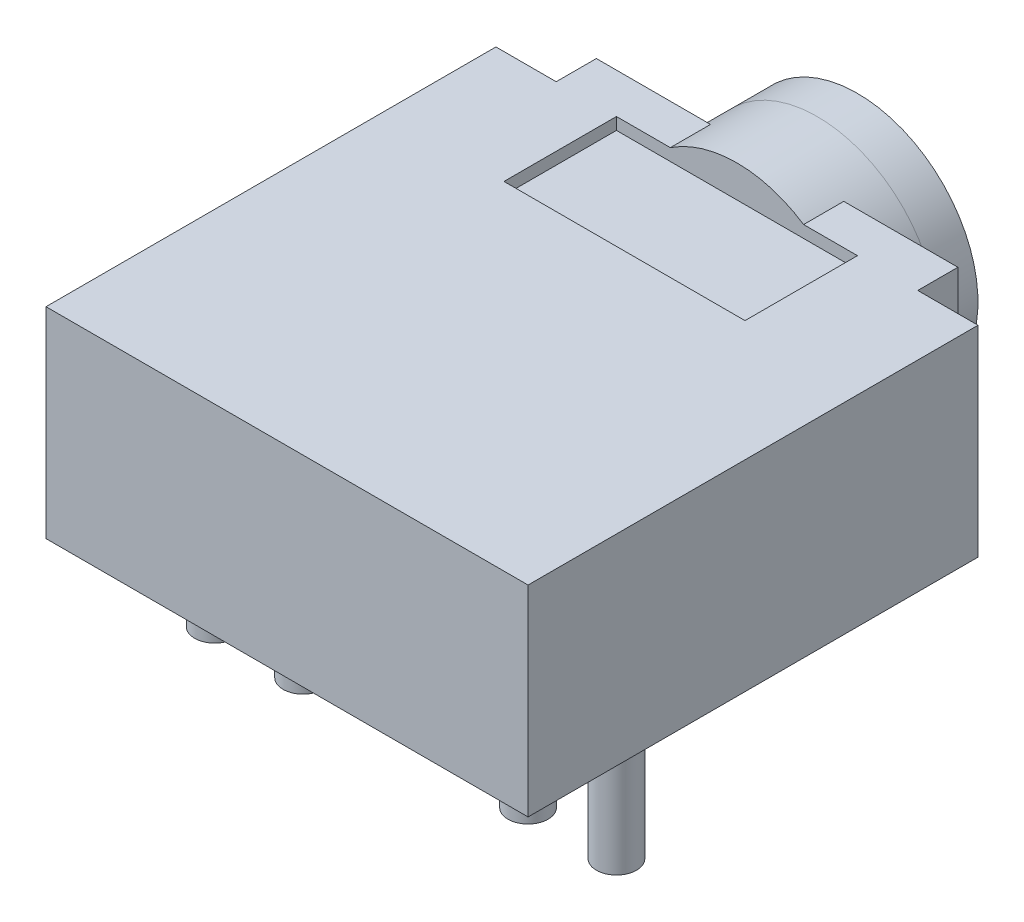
ISO-10303-21;
HEADER;
FILE_DESCRIPTION(('STEP AP214'),'2;1');
FILE_NAME('part.step','',(''),(''),'','','');
FILE_SCHEMA(('AUTOMOTIVE_DESIGN { 1 0 10303 214 1 1 1 1 }'));
ENDSEC;
DATA;
#1=APPLICATION_CONTEXT('core data for automotive mechanical design processes');
#2=APPLICATION_PROTOCOL_DEFINITION('international standard','automotive_design',2000,#1);
#3=PRODUCT_CONTEXT('',#1,'mechanical');
#4=PRODUCT('Part','Part','',(#3));
#5=PRODUCT_RELATED_PRODUCT_CATEGORY('part','',(#4));
#6=PRODUCT_DEFINITION_FORMATION('','',#4);
#7=PRODUCT_DEFINITION_CONTEXT('part definition',#1,'design');
#8=PRODUCT_DEFINITION('design','',#6,#7);
#9=PRODUCT_DEFINITION_SHAPE('','',#8);
#10=(LENGTH_UNIT() NAMED_UNIT(*) SI_UNIT(.MILLI.,.METRE.));
#11=(NAMED_UNIT(*) PLANE_ANGLE_UNIT() SI_UNIT($,.RADIAN.));
#12=(NAMED_UNIT(*) SI_UNIT($,.STERADIAN.) SOLID_ANGLE_UNIT());
#13=UNCERTAINTY_MEASURE_WITH_UNIT(LENGTH_MEASURE(1.E-05),#10,'distance_accuracy_value','');
#14=(GEOMETRIC_REPRESENTATION_CONTEXT(3) GLOBAL_UNCERTAINTY_ASSIGNED_CONTEXT((#13)) GLOBAL_UNIT_ASSIGNED_CONTEXT((#10,
#11,#12)) REPRESENTATION_CONTEXT('',''));
#15=CARTESIAN_POINT('',(0.,0.,0.));
#16=DIRECTION('',(0.,0.,1.));
#17=DIRECTION('',(1.,0.,0.));
#18=AXIS2_PLACEMENT_3D('',#15,#16,#17);
#19=CARTESIAN_POINT('',(-4.5,0.,-11.2));
#20=DIRECTION('',(0.,-1.,0.));
#21=DIRECTION('',(0.,0.,-1.));
#22=AXIS2_PLACEMENT_3D('',#19,#20,#21);
#23=PLANE('',#22);
#24=CARTESIAN_POINT('',(5.,0.,-3.2));
#25=DIRECTION('',(0.,-1.,0.));
#26=DIRECTION('',(0.,0.,1.));
#27=AXIS2_PLACEMENT_3D('',#24,#25,#26);
#28=CIRCLE('',#27,0.500000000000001);
#29=CARTESIAN_POINT('',(5.,0.,-2.7));
#30=VERTEX_POINT('',#29);
#31=EDGE_CURVE('E637',#30,#30,#28,.T.);
#32=ORIENTED_EDGE('',*,*,#31,.F.);
#33=EDGE_LOOP('',(#32));
#34=FACE_BOUND('',#33,.T.);
#35=CARTESIAN_POINT('',(-2.8,0.,-3.2));
#36=DIRECTION('',(0.,-1.,0.));
#37=DIRECTION('',(0.,0.,-1.));
#38=AXIS2_PLACEMENT_3D('',#35,#36,#37);
#39=CIRCLE('',#38,0.5);
#40=CARTESIAN_POINT('',(-2.8,0.,-3.7));
#41=VERTEX_POINT('',#40);
#42=EDGE_CURVE('E654',#41,#41,#39,.T.);
#43=ORIENTED_EDGE('',*,*,#42,.F.);
#44=EDGE_LOOP('',(#43));
#45=FACE_BOUND('',#44,.T.);
#46=DIRECTION('',(1.,0.,0.));
#47=VECTOR('',#46,1.);
#48=CARTESIAN_POINT('',(-4.5,0.,-11.2));
#49=LINE('',#48,#47);
#50=CARTESIAN_POINT('',(-1.6583123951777,0.,-11.2));
#51=VERTEX_POINT('',#50);
#52=CARTESIAN_POINT('',(1.6583123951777,0.,-11.2));
#53=VERTEX_POINT('',#52);
#54=EDGE_CURVE('E258',#51,#53,#49,.T.);
#55=ORIENTED_EDGE('',*,*,#54,.T.);
#56=DIRECTION('',(0.,0.,1.));
#57=VECTOR('',#56,1.);
#58=CARTESIAN_POINT('',(1.6583123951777,0.,-13.2));
#59=LINE('',#58,#57);
#60=CARTESIAN_POINT('',(1.6583123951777,0.,-12.2));
#61=VERTEX_POINT('',#60);
#62=EDGE_CURVE('E157',#53,#61,#59,.F.);
#63=ORIENTED_EDGE('',*,*,#62,.T.);
#64=DIRECTION('',(-1.,0.,0.));
#65=VECTOR('',#64,1.);
#66=CARTESIAN_POINT('',(4.5,0.,-12.2));
#67=LINE('',#66,#65);
#68=CARTESIAN_POINT('',(4.5,0.,-12.2));
#69=VERTEX_POINT('',#68);
#70=EDGE_CURVE('E212',#69,#61,#67,.T.);
#71=ORIENTED_EDGE('',*,*,#70,.F.);
#72=DIRECTION('',(0.,0.,-1.));
#73=VECTOR('',#72,1.);
#74=CARTESIAN_POINT('',(4.5,0.,-12.2));
#75=LINE('',#74,#73);
#76=CARTESIAN_POINT('',(4.5,0.,-11.2));
#77=VERTEX_POINT('',#76);
#78=EDGE_CURVE('E209',#77,#69,#75,.T.);
#79=ORIENTED_EDGE('',*,*,#78,.F.);
#80=DIRECTION('',(-1.,0.,0.));
#81=VECTOR('',#80,1.);
#82=CARTESIAN_POINT('',(4.5,0.,-11.2));
#83=LINE('',#82,#81);
#84=CARTESIAN_POINT('',(6.,0.,-11.2));
#85=VERTEX_POINT('',#84);
#86=EDGE_CURVE('E207',#85,#77,#83,.T.);
#87=ORIENTED_EDGE('',*,*,#86,.F.);
#88=DIRECTION('',(0.,0.,-1.));
#89=VECTOR('',#88,1.);
#90=CARTESIAN_POINT('',(6.,0.,-11.2));
#91=LINE('',#90,#89);
#92=CARTESIAN_POINT('',(6.,0.,0.));
#93=VERTEX_POINT('',#92);
#94=EDGE_CURVE('E205',#93,#85,#91,.T.);
#95=ORIENTED_EDGE('',*,*,#94,.F.);
#96=DIRECTION('',(1.,0.,0.));
#97=VECTOR('',#96,1.);
#98=CARTESIAN_POINT('',(-6.,0.,0.));
#99=LINE('',#98,#97);
#100=CARTESIAN_POINT('',(-6.,0.,0.));
#101=VERTEX_POINT('',#100);
#102=EDGE_CURVE('E203',#101,#93,#99,.T.);
#103=ORIENTED_EDGE('',*,*,#102,.F.);
#104=DIRECTION('',(0.,0.,1.));
#105=VECTOR('',#104,1.);
#106=CARTESIAN_POINT('',(-6.,0.,-11.2));
#107=LINE('',#106,#105);
#108=CARTESIAN_POINT('',(-6.,0.,-11.2));
#109=VERTEX_POINT('',#108);
#110=EDGE_CURVE('E201',#109,#101,#107,.T.);
#111=ORIENTED_EDGE('',*,*,#110,.F.);
#112=DIRECTION('',(-1.,0.,0.));
#113=VECTOR('',#112,1.);
#114=CARTESIAN_POINT('',(-4.5,0.,-11.2));
#115=LINE('',#114,#113);
#116=CARTESIAN_POINT('',(-4.5,0.,-11.2));
#117=VERTEX_POINT('',#116);
#118=EDGE_CURVE('E199',#117,#109,#115,.T.);
#119=ORIENTED_EDGE('',*,*,#118,.F.);
#120=DIRECTION('',(0.,0.,1.));
#121=VECTOR('',#120,1.);
#122=CARTESIAN_POINT('',(-4.5,0.,-12.2));
#123=LINE('',#122,#121);
#124=CARTESIAN_POINT('',(-4.5,0.,-12.2));
#125=VERTEX_POINT('',#124);
#126=EDGE_CURVE('E191',#125,#117,#123,.T.);
#127=ORIENTED_EDGE('',*,*,#126,.F.);
#128=CARTESIAN_POINT('',(-1.6583123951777,0.,-12.2));
#129=VERTEX_POINT('',#128);
#130=EDGE_CURVE('E211',#129,#125,#67,.T.);
#131=ORIENTED_EDGE('',*,*,#130,.F.);
#132=DIRECTION('',(0.,0.,1.));
#133=VECTOR('',#132,1.);
#134=CARTESIAN_POINT('',(-1.6583123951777,0.,-13.2));
#135=LINE('',#134,#133);
#136=EDGE_CURVE('E260',#129,#51,#135,.T.);
#137=ORIENTED_EDGE('',*,*,#136,.T.);
#138=EDGE_LOOP('',(#55,#63,#71,#79,#87,#95,#103,#111,#119,#127,#131,#137));
#139=FACE_BOUND('',#138,.T.);
#140=CARTESIAN_POINT('',(-5.,0.,-3.2));
#141=DIRECTION('',(0.,-1.,0.));
#142=DIRECTION('',(0.,0.,-1.));
#143=AXIS2_PLACEMENT_3D('',#140,#141,#142);
#144=CIRCLE('',#143,0.500000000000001);
#145=CARTESIAN_POINT('',(-5.,0.,-3.7));
#146=VERTEX_POINT('',#145);
#147=EDGE_CURVE('E660',#146,#146,#144,.T.);
#148=ORIENTED_EDGE('',*,*,#147,.F.);
#149=EDGE_LOOP('',(#148));
#150=FACE_BOUND('',#149,.T.);
#151=CARTESIAN_POINT('',(0.,0.,-8.4));
#152=DIRECTION('',(0.,-1.,0.));
#153=DIRECTION('',(0.,0.,-1.));
#154=AXIS2_PLACEMENT_3D('',#151,#152,#153);
#155=CIRCLE('',#154,0.5);
#156=CARTESIAN_POINT('',(0.,0.,-8.9));
#157=VERTEX_POINT('',#156);
#158=EDGE_CURVE('E648',#157,#157,#155,.T.);
#159=ORIENTED_EDGE('',*,*,#158,.F.);
#160=EDGE_LOOP('',(#159));
#161=FACE_BOUND('',#160,.T.);
#162=CARTESIAN_POINT('',(2.8,0.,-3.2));
#163=DIRECTION('',(0.,-1.,0.));
#164=DIRECTION('',(0.,0.,1.));
#165=AXIS2_PLACEMENT_3D('',#162,#163,#164);
#166=CIRCLE('',#165,0.5);
#167=CARTESIAN_POINT('',(2.8,0.,-2.7));
#168=VERTEX_POINT('',#167);
#169=EDGE_CURVE('E638',#168,#168,#166,.T.);
#170=ORIENTED_EDGE('',*,*,#169,.F.);
#171=EDGE_LOOP('',(#170));
#172=FACE_BOUND('',#171,.T.);
#173=ADVANCED_FACE('F30',(#34,#45,#139,#150,#161,#172),#23,.T.);
#174=CARTESIAN_POINT('',(4.5,5.,-12.2));
#175=DIRECTION('',(0.,0.,1.));
#176=DIRECTION('',(1.,0.,0.));
#177=AXIS2_PLACEMENT_3D('',#174,#175,#176);
#178=PLANE('',#177);
#179=CARTESIAN_POINT('',(0.,2.5,-12.2));
#180=DIRECTION('',(0.,0.,1.));
#181=DIRECTION('',(1.,0.,0.));
#182=AXIS2_PLACEMENT_3D('',#179,#180,#181);
#183=CIRCLE('',#182,3.);
#184=CARTESIAN_POINT('',(-1.6583123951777,5.,-12.2));
#185=VERTEX_POINT('',#184);
#186=EDGE_CURVE('E153',#129,#185,#183,.F.);
#187=ORIENTED_EDGE('',*,*,#186,.F.);
#188=ORIENTED_EDGE('',*,*,#130,.T.);
#189=DIRECTION('',(0.,-1.,0.));
#190=VECTOR('',#189,1.);
#191=CARTESIAN_POINT('',(-4.5,5.,-12.2));
#192=LINE('',#191,#190);
#193=CARTESIAN_POINT('',(-4.5,5.,-12.2));
#194=VERTEX_POINT('',#193);
#195=EDGE_CURVE('E234',#194,#125,#192,.T.);
#196=ORIENTED_EDGE('',*,*,#195,.F.);
#197=DIRECTION('',(-1.,0.,0.));
#198=VECTOR('',#197,1.);
#199=CARTESIAN_POINT('',(4.5,5.,-12.2));
#200=LINE('',#199,#198);
#201=EDGE_CURVE('E230',#185,#194,#200,.T.);
#202=ORIENTED_EDGE('',*,*,#201,.F.);
#203=EDGE_LOOP('',(#187,#188,#196,#202));
#204=FACE_BOUND('',#203,.T.);
#205=ADVANCED_FACE('F300',(#204),#178,.F.);
#206=CARTESIAN_POINT('',(1.6583123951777,5.,-12.2));
#207=VERTEX_POINT('',#206);
#208=EDGE_CURVE('E268',#207,#61,#183,.F.);
#209=ORIENTED_EDGE('',*,*,#208,.F.);
#210=CARTESIAN_POINT('',(4.5,5.,-12.2));
#211=VERTEX_POINT('',#210);
#212=EDGE_CURVE('E231',#211,#207,#200,.T.);
#213=ORIENTED_EDGE('',*,*,#212,.F.);
#214=DIRECTION('',(0.,-1.,0.));
#215=VECTOR('',#214,1.);
#216=CARTESIAN_POINT('',(4.5,5.,-12.2));
#217=LINE('',#216,#215);
#218=EDGE_CURVE('E237',#211,#69,#217,.T.);
#219=ORIENTED_EDGE('',*,*,#218,.T.);
#220=ORIENTED_EDGE('',*,*,#70,.T.);
#221=EDGE_LOOP('',(#209,#213,#219,#220));
#222=FACE_BOUND('',#221,.T.);
#223=ADVANCED_FACE('F305',(#222),#178,.F.);
#224=CARTESIAN_POINT('',(-4.5,5.,-11.2));
#225=DIRECTION('',(0.,-1.,0.));
#226=DIRECTION('',(0.,0.,-1.));
#227=AXIS2_PLACEMENT_3D('',#224,#225,#226);
#228=PLANE('',#227);
#229=DIRECTION('',(0.,0.,1.));
#230=VECTOR('',#229,1.);
#231=CARTESIAN_POINT('',(1.6583123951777,5.,-13.2));
#232=LINE('',#231,#230);
#233=CARTESIAN_POINT('',(1.6583123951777,5.,-11.2));
#234=VERTEX_POINT('',#233);
#235=EDGE_CURVE('E271',#234,#207,#232,.F.);
#236=ORIENTED_EDGE('',*,*,#235,.F.);
#237=DIRECTION('',(-1.,0.,0.));
#238=VECTOR('',#237,1.);
#239=CARTESIAN_POINT('',(-3.,5.,-11.2));
#240=LINE('',#239,#238);
#241=CARTESIAN_POINT('',(3.,5.,-11.2));
#242=VERTEX_POINT('',#241);
#243=EDGE_CURVE('E165',#242,#234,#240,.T.);
#244=ORIENTED_EDGE('',*,*,#243,.F.);
#245=DIRECTION('',(0.,0.,-1.));
#246=VECTOR('',#245,1.);
#247=CARTESIAN_POINT('',(3.,5.,-11.2));
#248=LINE('',#247,#246);
#249=CARTESIAN_POINT('',(3.,5.,-8.4));
#250=VERTEX_POINT('',#249);
#251=EDGE_CURVE('E170',#250,#242,#248,.T.);
#252=ORIENTED_EDGE('',*,*,#251,.F.);
#253=DIRECTION('',(1.,0.,0.));
#254=VECTOR('',#253,1.);
#255=CARTESIAN_POINT('',(-3.,5.,-8.4));
#256=LINE('',#255,#254);
#257=CARTESIAN_POINT('',(-3.,5.,-8.4));
#258=VERTEX_POINT('',#257);
#259=EDGE_CURVE('E174',#258,#250,#256,.T.);
#260=ORIENTED_EDGE('',*,*,#259,.F.);
#261=DIRECTION('',(0.,0.,1.));
#262=VECTOR('',#261,1.);
#263=CARTESIAN_POINT('',(-3.,5.,-11.2));
#264=LINE('',#263,#262);
#265=CARTESIAN_POINT('',(-3.,5.,-11.2));
#266=VERTEX_POINT('',#265);
#267=EDGE_CURVE('E56',#266,#258,#264,.T.);
#268=ORIENTED_EDGE('',*,*,#267,.F.);
#269=CARTESIAN_POINT('',(-1.6583123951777,5.,-11.2));
#270=VERTEX_POINT('',#269);
#271=EDGE_CURVE('E163',#270,#266,#240,.T.);
#272=ORIENTED_EDGE('',*,*,#271,.F.);
#273=DIRECTION('',(0.,0.,1.));
#274=VECTOR('',#273,1.);
#275=CARTESIAN_POINT('',(-1.6583123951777,5.,-13.2));
#276=LINE('',#275,#274);
#277=EDGE_CURVE('E147',#185,#270,#276,.T.);
#278=ORIENTED_EDGE('',*,*,#277,.F.);
#279=ORIENTED_EDGE('',*,*,#201,.T.);
#280=DIRECTION('',(0.,0.,1.));
#281=VECTOR('',#280,1.);
#282=CARTESIAN_POINT('',(-4.5,5.,-12.2));
#283=LINE('',#282,#281);
#284=CARTESIAN_POINT('',(-4.5,5.,-11.2));
#285=VERTEX_POINT('',#284);
#286=EDGE_CURVE('E215',#194,#285,#283,.T.);
#287=ORIENTED_EDGE('',*,*,#286,.T.);
#288=DIRECTION('',(-1.,0.,0.));
#289=VECTOR('',#288,1.);
#290=CARTESIAN_POINT('',(-4.5,5.,-11.2));
#291=LINE('',#290,#289);
#292=CARTESIAN_POINT('',(-6.,5.,-11.2));
#293=VERTEX_POINT('',#292);
#294=EDGE_CURVE('E218',#285,#293,#291,.T.);
#295=ORIENTED_EDGE('',*,*,#294,.T.);
#296=DIRECTION('',(0.,0.,1.));
#297=VECTOR('',#296,1.);
#298=CARTESIAN_POINT('',(-6.,5.,-11.2));
#299=LINE('',#298,#297);
#300=CARTESIAN_POINT('',(-6.,5.,0.));
#301=VERTEX_POINT('',#300);
#302=EDGE_CURVE('E220',#293,#301,#299,.T.);
#303=ORIENTED_EDGE('',*,*,#302,.T.);
#304=DIRECTION('',(1.,0.,0.));
#305=VECTOR('',#304,1.);
#306=CARTESIAN_POINT('',(-6.,5.,0.));
#307=LINE('',#306,#305);
#308=CARTESIAN_POINT('',(6.,5.,0.));
#309=VERTEX_POINT('',#308);
#310=EDGE_CURVE('E222',#301,#309,#307,.T.);
#311=ORIENTED_EDGE('',*,*,#310,.T.);
#312=DIRECTION('',(0.,0.,-1.));
#313=VECTOR('',#312,1.);
#314=CARTESIAN_POINT('',(6.,5.,-11.2));
#315=LINE('',#314,#313);
#316=CARTESIAN_POINT('',(6.,5.,-11.2));
#317=VERTEX_POINT('',#316);
#318=EDGE_CURVE('E224',#309,#317,#315,.T.);
#319=ORIENTED_EDGE('',*,*,#318,.T.);
#320=DIRECTION('',(-1.,0.,0.));
#321=VECTOR('',#320,1.);
#322=CARTESIAN_POINT('',(4.5,5.,-11.2));
#323=LINE('',#322,#321);
#324=CARTESIAN_POINT('',(4.5,5.,-11.2));
#325=VERTEX_POINT('',#324);
#326=EDGE_CURVE('E226',#317,#325,#323,.T.);
#327=ORIENTED_EDGE('',*,*,#326,.T.);
#328=DIRECTION('',(0.,0.,-1.));
#329=VECTOR('',#328,1.);
#330=CARTESIAN_POINT('',(4.5,5.,-12.2));
#331=LINE('',#330,#329);
#332=EDGE_CURVE('E228',#325,#211,#331,.T.);
#333=ORIENTED_EDGE('',*,*,#332,.T.);
#334=ORIENTED_EDGE('',*,*,#212,.T.);
#335=EDGE_LOOP('',(#236,#244,#252,#260,#268,#272,#278,#279,#287,#295,#303,#311,#319,#327,#333,#334));
#336=FACE_BOUND('',#335,.T.);
#337=ADVANCED_FACE('F168',(#336),#228,.F.);
#338=CARTESIAN_POINT('',(-4.5,5.,-12.2));
#339=DIRECTION('',(1.,0.,0.));
#340=DIRECTION('',(0.,0.,-1.));
#341=AXIS2_PLACEMENT_3D('',#338,#339,#340);
#342=PLANE('',#341);
#343=ORIENTED_EDGE('',*,*,#126,.T.);
#344=DIRECTION('',(0.,-1.,0.));
#345=VECTOR('',#344,1.);
#346=CARTESIAN_POINT('',(-4.5,5.,-11.2));
#347=LINE('',#346,#345);
#348=EDGE_CURVE('E11',#285,#117,#347,.T.);
#349=ORIENTED_EDGE('',*,*,#348,.F.);
#350=ORIENTED_EDGE('',*,*,#286,.F.);
#351=ORIENTED_EDGE('',*,*,#195,.T.);
#352=EDGE_LOOP('',(#343,#349,#350,#351));
#353=FACE_BOUND('',#352,.T.);
#354=ADVANCED_FACE('F32',(#353),#342,.F.);
#355=CARTESIAN_POINT('',(-4.5,5.,-11.2));
#356=DIRECTION('',(0.,0.,1.));
#357=DIRECTION('',(1.,0.,0.));
#358=AXIS2_PLACEMENT_3D('',#355,#356,#357);
#359=PLANE('',#358);
#360=ORIENTED_EDGE('',*,*,#118,.T.);
#361=DIRECTION('',(0.,-1.,0.));
#362=VECTOR('',#361,1.);
#363=CARTESIAN_POINT('',(-6.,5.,-11.2));
#364=LINE('',#363,#362);
#365=EDGE_CURVE('E41',#293,#109,#364,.T.);
#366=ORIENTED_EDGE('',*,*,#365,.F.);
#367=ORIENTED_EDGE('',*,*,#294,.F.);
#368=ORIENTED_EDGE('',*,*,#348,.T.);
#369=EDGE_LOOP('',(#360,#366,#367,#368));
#370=FACE_BOUND('',#369,.T.);
#371=ADVANCED_FACE('F326',(#370),#359,.F.);
#372=CARTESIAN_POINT('',(-6.,5.,-11.2));
#373=DIRECTION('',(1.,0.,0.));
#374=DIRECTION('',(0.,0.,-1.));
#375=AXIS2_PLACEMENT_3D('',#372,#373,#374);
#376=PLANE('',#375);
#377=ORIENTED_EDGE('',*,*,#110,.T.);
#378=DIRECTION('',(0.,-1.,0.));
#379=VECTOR('',#378,1.);
#380=CARTESIAN_POINT('',(-6.,5.,0.));
#381=LINE('',#380,#379);
#382=EDGE_CURVE('E249',#301,#101,#381,.T.);
#383=ORIENTED_EDGE('',*,*,#382,.F.);
#384=ORIENTED_EDGE('',*,*,#302,.F.);
#385=ORIENTED_EDGE('',*,*,#365,.T.);
#386=EDGE_LOOP('',(#377,#383,#384,#385));
#387=FACE_BOUND('',#386,.T.);
#388=ADVANCED_FACE('F323',(#387),#376,.F.);
#389=CARTESIAN_POINT('',(-6.,5.,0.));
#390=DIRECTION('',(0.,0.,-1.));
#391=DIRECTION('',(-1.,0.,0.));
#392=AXIS2_PLACEMENT_3D('',#389,#390,#391);
#393=PLANE('',#392);
#394=ORIENTED_EDGE('',*,*,#102,.T.);
#395=DIRECTION('',(0.,-1.,0.));
#396=VECTOR('',#395,1.);
#397=CARTESIAN_POINT('',(6.,5.,0.));
#398=LINE('',#397,#396);
#399=EDGE_CURVE('E246',#309,#93,#398,.T.);
#400=ORIENTED_EDGE('',*,*,#399,.F.);
#401=ORIENTED_EDGE('',*,*,#310,.F.);
#402=ORIENTED_EDGE('',*,*,#382,.T.);
#403=EDGE_LOOP('',(#394,#400,#401,#402));
#404=FACE_BOUND('',#403,.T.);
#405=ADVANCED_FACE('F319',(#404),#393,.F.);
#406=CARTESIAN_POINT('',(6.,5.,-11.2));
#407=DIRECTION('',(-1.,0.,0.));
#408=DIRECTION('',(0.,0.,1.));
#409=AXIS2_PLACEMENT_3D('',#406,#407,#408);
#410=PLANE('',#409);
#411=ORIENTED_EDGE('',*,*,#94,.T.);
#412=DIRECTION('',(0.,-1.,0.));
#413=VECTOR('',#412,1.);
#414=CARTESIAN_POINT('',(6.,5.,-11.2));
#415=LINE('',#414,#413);
#416=EDGE_CURVE('E243',#317,#85,#415,.T.);
#417=ORIENTED_EDGE('',*,*,#416,.F.);
#418=ORIENTED_EDGE('',*,*,#318,.F.);
#419=ORIENTED_EDGE('',*,*,#399,.T.);
#420=EDGE_LOOP('',(#411,#417,#418,#419));
#421=FACE_BOUND('',#420,.T.);
#422=ADVANCED_FACE('F315',(#421),#410,.F.);
#423=CARTESIAN_POINT('',(4.5,5.,-11.2));
#424=DIRECTION('',(0.,0.,1.));
#425=DIRECTION('',(1.,0.,0.));
#426=AXIS2_PLACEMENT_3D('',#423,#424,#425);
#427=PLANE('',#426);
#428=ORIENTED_EDGE('',*,*,#86,.T.);
#429=DIRECTION('',(0.,-1.,0.));
#430=VECTOR('',#429,1.);
#431=CARTESIAN_POINT('',(4.5,5.,-11.2));
#432=LINE('',#431,#430);
#433=EDGE_CURVE('E240',#325,#77,#432,.T.);
#434=ORIENTED_EDGE('',*,*,#433,.F.);
#435=ORIENTED_EDGE('',*,*,#326,.F.);
#436=ORIENTED_EDGE('',*,*,#416,.T.);
#437=EDGE_LOOP('',(#428,#434,#435,#436));
#438=FACE_BOUND('',#437,.T.);
#439=ADVANCED_FACE('F294',(#438),#427,.F.);
#440=CARTESIAN_POINT('',(4.5,5.,-12.2));
#441=DIRECTION('',(-1.,0.,0.));
#442=DIRECTION('',(0.,0.,1.));
#443=AXIS2_PLACEMENT_3D('',#440,#441,#442);
#444=PLANE('',#443);
#445=ORIENTED_EDGE('',*,*,#78,.T.);
#446=ORIENTED_EDGE('',*,*,#218,.F.);
#447=ORIENTED_EDGE('',*,*,#332,.F.);
#448=ORIENTED_EDGE('',*,*,#433,.T.);
#449=EDGE_LOOP('',(#445,#446,#447,#448));
#450=FACE_BOUND('',#449,.T.);
#451=ADVANCED_FACE('F287',(#450),#444,.F.);
#452=CARTESIAN_POINT('',(-3.,4.7,-11.2));
#453=DIRECTION('',(-1.,0.,0.));
#454=DIRECTION('',(0.,0.,1.));
#455=AXIS2_PLACEMENT_3D('',#452,#453,#454);
#456=PLANE('',#455);
#457=ORIENTED_EDGE('',*,*,#267,.T.);
#458=DIRECTION('',(0.,1.,0.));
#459=VECTOR('',#458,1.);
#460=CARTESIAN_POINT('',(-3.,4.7,-8.4));
#461=LINE('',#460,#459);
#462=CARTESIAN_POINT('',(-3.,4.7,-8.4));
#463=VERTEX_POINT('',#462);
#464=EDGE_CURVE('E188',#463,#258,#461,.T.);
#465=ORIENTED_EDGE('',*,*,#464,.F.);
#466=DIRECTION('',(0.,0.,1.));
#467=VECTOR('',#466,1.);
#468=CARTESIAN_POINT('',(-3.,4.7,-11.2));
#469=LINE('',#468,#467);
#470=CARTESIAN_POINT('',(-3.,4.7,-11.2));
#471=VERTEX_POINT('',#470);
#472=EDGE_CURVE('E172',#471,#463,#469,.T.);
#473=ORIENTED_EDGE('',*,*,#472,.F.);
#474=DIRECTION('',(0.,1.,0.));
#475=VECTOR('',#474,1.);
#476=CARTESIAN_POINT('',(-3.,4.7,-11.2));
#477=LINE('',#476,#475);
#478=EDGE_CURVE('E189',#471,#266,#477,.T.);
#479=ORIENTED_EDGE('',*,*,#478,.T.);
#480=EDGE_LOOP('',(#457,#465,#473,#479));
#481=FACE_BOUND('',#480,.T.);
#482=ADVANCED_FACE('F285',(#481),#456,.F.);
#483=CARTESIAN_POINT('',(-3.,4.7,-11.2));
#484=DIRECTION('',(0.,0.,-1.));
#485=DIRECTION('',(-1.,0.,0.));
#486=AXIS2_PLACEMENT_3D('',#483,#484,#485);
#487=PLANE('',#486);
#488=ORIENTED_EDGE('',*,*,#478,.F.);
#489=DIRECTION('',(-1.,0.,0.));
#490=VECTOR('',#489,1.);
#491=CARTESIAN_POINT('',(-3.,4.7,-11.2));
#492=LINE('',#491,#490);
#493=CARTESIAN_POINT('',(3.,4.7,-11.2));
#494=VERTEX_POINT('',#493);
#495=EDGE_CURVE('E186',#494,#471,#492,.T.);
#496=ORIENTED_EDGE('',*,*,#495,.F.);
#497=DIRECTION('',(0.,1.,0.));
#498=VECTOR('',#497,1.);
#499=CARTESIAN_POINT('',(3.,4.7,-11.2));
#500=LINE('',#499,#498);
#501=EDGE_CURVE('E192',#494,#242,#500,.T.);
#502=ORIENTED_EDGE('',*,*,#501,.T.);
#503=ORIENTED_EDGE('',*,*,#243,.T.);
#504=CARTESIAN_POINT('',(0.,2.5,-11.2));
#505=DIRECTION('',(0.,0.,-1.));
#506=DIRECTION('',(-1.,0.,0.));
#507=AXIS2_PLACEMENT_3D('',#504,#505,#506);
#508=CIRCLE('',#507,3.);
#509=EDGE_CURVE('E150',#270,#234,#508,.T.);
#510=ORIENTED_EDGE('',*,*,#509,.F.);
#511=ORIENTED_EDGE('',*,*,#271,.T.);
#512=EDGE_LOOP('',(#488,#496,#502,#503,#510,#511));
#513=FACE_BOUND('',#512,.T.);
#514=ADVANCED_FACE('F162',(#513),#487,.F.);
#515=CARTESIAN_POINT('',(3.,4.7,-11.2));
#516=DIRECTION('',(1.,0.,0.));
#517=DIRECTION('',(0.,0.,-1.));
#518=AXIS2_PLACEMENT_3D('',#515,#516,#517);
#519=PLANE('',#518);
#520=ORIENTED_EDGE('',*,*,#251,.T.);
#521=ORIENTED_EDGE('',*,*,#501,.F.);
#522=DIRECTION('',(0.,0.,-1.));
#523=VECTOR('',#522,1.);
#524=CARTESIAN_POINT('',(3.,4.7,-11.2));
#525=LINE('',#524,#523);
#526=CARTESIAN_POINT('',(3.,4.7,-8.4));
#527=VERTEX_POINT('',#526);
#528=EDGE_CURVE('E183',#527,#494,#525,.T.);
#529=ORIENTED_EDGE('',*,*,#528,.F.);
#530=DIRECTION('',(0.,1.,0.));
#531=VECTOR('',#530,1.);
#532=CARTESIAN_POINT('',(3.,4.7,-8.4));
#533=LINE('',#532,#531);
#534=EDGE_CURVE('E194',#527,#250,#533,.T.);
#535=ORIENTED_EDGE('',*,*,#534,.T.);
#536=EDGE_LOOP('',(#520,#521,#529,#535));
#537=FACE_BOUND('',#536,.T.);
#538=ADVANCED_FACE('F280',(#537),#519,.F.);
#539=CARTESIAN_POINT('',(-3.,4.7,-8.4));
#540=DIRECTION('',(0.,0.,1.));
#541=DIRECTION('',(1.,0.,0.));
#542=AXIS2_PLACEMENT_3D('',#539,#540,#541);
#543=PLANE('',#542);
#544=ORIENTED_EDGE('',*,*,#259,.T.);
#545=ORIENTED_EDGE('',*,*,#534,.F.);
#546=DIRECTION('',(1.,0.,0.));
#547=VECTOR('',#546,1.);
#548=CARTESIAN_POINT('',(-3.,4.7,-8.4));
#549=LINE('',#548,#547);
#550=EDGE_CURVE('E180',#463,#527,#549,.T.);
#551=ORIENTED_EDGE('',*,*,#550,.F.);
#552=ORIENTED_EDGE('',*,*,#464,.T.);
#553=EDGE_LOOP('',(#544,#545,#551,#552));
#554=FACE_BOUND('',#553,.T.);
#555=ADVANCED_FACE('F276',(#554),#543,.F.);
#556=CARTESIAN_POINT('',(-3.,4.7,-8.4));
#557=DIRECTION('',(0.,1.,0.));
#558=DIRECTION('',(0.,0.,1.));
#559=AXIS2_PLACEMENT_3D('',#556,#557,#558);
#560=PLANE('',#559);
#561=ORIENTED_EDGE('',*,*,#472,.T.);
#562=ORIENTED_EDGE('',*,*,#550,.T.);
#563=ORIENTED_EDGE('',*,*,#528,.T.);
#564=ORIENTED_EDGE('',*,*,#495,.T.);
#565=EDGE_LOOP('',(#561,#562,#563,#564));
#566=FACE_BOUND('',#565,.T.);
#567=ADVANCED_FACE('F283',(#566),#560,.T.);
#568=CARTESIAN_POINT('',(0.,2.5,-13.2));
#569=DIRECTION('',(0.,0.,1.));
#570=DIRECTION('',(1.,0.,0.));
#571=AXIS2_PLACEMENT_3D('',#568,#569,#570);
#572=CYLINDRICAL_SURFACE('',#571,3.);
#573=CARTESIAN_POINT('',(0.,2.5,-13.2));
#574=DIRECTION('',(0.,0.,-1.));
#575=DIRECTION('',(-1.,0.,0.));
#576=AXIS2_PLACEMENT_3D('',#573,#574,#575);
#577=CIRCLE('',#576,2.999);
#578=CARTESIAN_POINT('',(-2.999,2.5,-13.2));
#579=VERTEX_POINT('',#578);
#580=EDGE_CURVE('E166',#579,#579,#577,.T.);
#581=ORIENTED_EDGE('',*,*,#580,.F.);
#582=EDGE_LOOP('',(#581));
#583=FACE_BOUND('',#582,.T.);
#584=ORIENTED_EDGE('',*,*,#509,.T.);
#585=ORIENTED_EDGE('',*,*,#235,.T.);
#586=ORIENTED_EDGE('',*,*,#208,.T.);
#587=ORIENTED_EDGE('',*,*,#62,.F.);
#588=EDGE_CURVE('E48',#53,#51,#508,.T.);
#589=ORIENTED_EDGE('',*,*,#588,.T.);
#590=ORIENTED_EDGE('',*,*,#136,.F.);
#591=ORIENTED_EDGE('',*,*,#186,.T.);
#592=ORIENTED_EDGE('',*,*,#277,.T.);
#593=EDGE_LOOP('',(#584,#585,#586,#587,#589,#590,#591,#592));
#594=FACE_BOUND('',#593,.T.);
#595=ADVANCED_FACE('F149',(#583,#594),#572,.T.);
#596=CARTESIAN_POINT('',(0.,2.5,-11.2));
#597=DIRECTION('',(0.,0.,-1.));
#598=DIRECTION('',(-1.,0.,0.));
#599=AXIS2_PLACEMENT_3D('',#596,#597,#598);
#600=PLANE('',#599);
#601=ORIENTED_EDGE('',*,*,#54,.F.);
#602=ORIENTED_EDGE('',*,*,#588,.F.);
#603=EDGE_LOOP('',(#601,#602));
#604=FACE_BOUND('',#603,.T.);
#605=ADVANCED_FACE('F377',(#604),#600,.F.);
#606=CARTESIAN_POINT('',(0.,2.5,-14.2));
#607=DIRECTION('',(0.,0.,1.));
#608=DIRECTION('',(1.,0.,0.));
#609=AXIS2_PLACEMENT_3D('',#606,#607,#608);
#610=CYLINDRICAL_SURFACE('',#609,2.999);
#611=CARTESIAN_POINT('',(0.,2.5,-14.2));
#612=DIRECTION('',(0.,0.,-1.));
#613=DIRECTION('',(-1.,0.,0.));
#614=AXIS2_PLACEMENT_3D('',#611,#612,#613);
#615=CIRCLE('',#614,2.999);
#616=CARTESIAN_POINT('',(-2.999,2.5,-14.2));
#617=VERTEX_POINT('',#616);
#618=EDGE_CURVE('E353',#617,#617,#615,.T.);
#619=ORIENTED_EDGE('',*,*,#618,.F.);
#620=EDGE_LOOP('',(#619));
#621=FACE_BOUND('',#620,.T.);
#622=ORIENTED_EDGE('',*,*,#580,.T.);
#623=EDGE_LOOP('',(#622));
#624=FACE_BOUND('',#623,.T.);
#625=ADVANCED_FACE('F366',(#621,#624),#610,.T.);
#626=CARTESIAN_POINT('',(0.,2.5,-14.2));
#627=DIRECTION('',(0.,0.,-1.));
#628=DIRECTION('',(-1.,0.,0.));
#629=AXIS2_PLACEMENT_3D('',#626,#627,#628);
#630=PLANE('',#629);
#631=CARTESIAN_POINT('',(0.,2.5,-14.2));
#632=DIRECTION('',(0.,0.,-1.));
#633=DIRECTION('',(-1.,0.,0.));
#634=AXIS2_PLACEMENT_3D('',#631,#632,#633);
#635=CIRCLE('',#634,1.75);
#636=CARTESIAN_POINT('',(-1.75,2.5,-14.2));
#637=VERTEX_POINT('',#636);
#638=EDGE_CURVE('E360',#637,#637,#635,.T.);
#639=ORIENTED_EDGE('',*,*,#638,.F.);
#640=EDGE_LOOP('',(#639));
#641=FACE_BOUND('',#640,.T.);
#642=ORIENTED_EDGE('',*,*,#618,.T.);
#643=EDGE_LOOP('',(#642));
#644=FACE_BOUND('',#643,.T.);
#645=ADVANCED_FACE('F376',(#641,#644),#630,.T.);
#646=CARTESIAN_POINT('',(0.,2.5,-4.2));
#647=DIRECTION('',(0.,0.,-1.));
#648=DIRECTION('',(-1.,0.,0.));
#649=AXIS2_PLACEMENT_3D('',#646,#647,#648);
#650=CYLINDRICAL_SURFACE('',#649,1.75);
#651=CARTESIAN_POINT('',(0.,2.5,-4.2));
#652=DIRECTION('',(0.,0.,-1.));
#653=DIRECTION('',(-1.,0.,0.));
#654=AXIS2_PLACEMENT_3D('',#651,#652,#653);
#655=CIRCLE('',#654,1.75);
#656=CARTESIAN_POINT('',(-1.75,2.5,-4.2));
#657=VERTEX_POINT('',#656);
#658=EDGE_CURVE('E355',#657,#657,#655,.T.);
#659=ORIENTED_EDGE('',*,*,#658,.F.);
#660=EDGE_LOOP('',(#659));
#661=FACE_BOUND('',#660,.T.);
#662=ORIENTED_EDGE('',*,*,#638,.T.);
#663=EDGE_LOOP('',(#662));
#664=FACE_BOUND('',#663,.T.);
#665=ADVANCED_FACE('F416',(#661,#664),#650,.F.);
#666=CARTESIAN_POINT('',(0.,2.5,-4.2));
#667=DIRECTION('',(0.,0.,-1.));
#668=DIRECTION('',(-1.,0.,0.));
#669=AXIS2_PLACEMENT_3D('',#666,#667,#668);
#670=PLANE('',#669);
#671=ORIENTED_EDGE('',*,*,#658,.T.);
#672=EDGE_LOOP('',(#671));
#673=FACE_BOUND('',#672,.T.);
#674=ADVANCED_FACE('F423',(#673),#670,.T.);
#675=CARTESIAN_POINT('',(-5.,-3.,-3.2));
#676=DIRECTION('',(0.,1.,0.));
#677=DIRECTION('',(0.,0.,1.));
#678=AXIS2_PLACEMENT_3D('',#675,#676,#677);
#679=CYLINDRICAL_SURFACE('',#678,0.500000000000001);
#680=CARTESIAN_POINT('',(-5.,-3.,-3.2));
#681=DIRECTION('',(0.,-1.,0.));
#682=DIRECTION('',(0.,0.,-1.));
#683=AXIS2_PLACEMENT_3D('',#680,#681,#682);
#684=CIRCLE('',#683,0.500000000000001);
#685=CARTESIAN_POINT('',(-5.,-3.,-3.7));
#686=VERTEX_POINT('',#685);
#687=EDGE_CURVE('E663',#686,#686,#684,.T.);
#688=ORIENTED_EDGE('',*,*,#687,.F.);
#689=EDGE_LOOP('',(#688));
#690=FACE_BOUND('',#689,.T.);
#691=ORIENTED_EDGE('',*,*,#147,.T.);
#692=EDGE_LOOP('',(#691));
#693=FACE_BOUND('',#692,.T.);
#694=ADVANCED_FACE('F430',(#690,#693),#679,.T.);
#695=CARTESIAN_POINT('',(-5.,-3.,-3.2));
#696=DIRECTION('',(0.,-1.,0.));
#697=DIRECTION('',(0.,0.,-1.));
#698=AXIS2_PLACEMENT_3D('',#695,#696,#697);
#699=PLANE('',#698);
#700=ORIENTED_EDGE('',*,*,#687,.T.);
#701=EDGE_LOOP('',(#700));
#702=FACE_BOUND('',#701,.T.);
#703=ADVANCED_FACE('F438',(#702),#699,.T.);
#704=CARTESIAN_POINT('',(-2.8,-3.,-3.2));
#705=DIRECTION('',(0.,1.,0.));
#706=DIRECTION('',(0.,0.,1.));
#707=AXIS2_PLACEMENT_3D('',#704,#705,#706);
#708=CYLINDRICAL_SURFACE('',#707,0.5);
#709=CARTESIAN_POINT('',(-2.8,-3.,-3.2));
#710=DIRECTION('',(0.,-1.,0.));
#711=DIRECTION('',(0.,0.,-1.));
#712=AXIS2_PLACEMENT_3D('',#709,#710,#711);
#713=CIRCLE('',#712,0.5);
#714=CARTESIAN_POINT('',(-2.8,-3.,-3.7));
#715=VERTEX_POINT('',#714);
#716=EDGE_CURVE('E657',#715,#715,#713,.T.);
#717=ORIENTED_EDGE('',*,*,#716,.F.);
#718=EDGE_LOOP('',(#717));
#719=FACE_BOUND('',#718,.T.);
#720=ORIENTED_EDGE('',*,*,#42,.T.);
#721=EDGE_LOOP('',(#720));
#722=FACE_BOUND('',#721,.T.);
#723=ADVANCED_FACE('F446',(#719,#722),#708,.T.);
#724=CARTESIAN_POINT('',(-2.8,-3.,-3.2));
#725=DIRECTION('',(0.,-1.,0.));
#726=DIRECTION('',(0.,0.,-1.));
#727=AXIS2_PLACEMENT_3D('',#724,#725,#726);
#728=PLANE('',#727);
#729=ORIENTED_EDGE('',*,*,#716,.T.);
#730=EDGE_LOOP('',(#729));
#731=FACE_BOUND('',#730,.T.);
#732=ADVANCED_FACE('F454',(#731),#728,.T.);
#733=CARTESIAN_POINT('',(0.,-3.,-8.4));
#734=DIRECTION('',(0.,1.,0.));
#735=DIRECTION('',(0.,0.,1.));
#736=AXIS2_PLACEMENT_3D('',#733,#734,#735);
#737=CYLINDRICAL_SURFACE('',#736,0.5);
#738=CARTESIAN_POINT('',(0.,-3.,-8.4));
#739=DIRECTION('',(0.,-1.,0.));
#740=DIRECTION('',(0.,0.,-1.));
#741=AXIS2_PLACEMENT_3D('',#738,#739,#740);
#742=CIRCLE('',#741,0.5);
#743=CARTESIAN_POINT('',(0.,-3.,-8.9));
#744=VERTEX_POINT('',#743);
#745=EDGE_CURVE('E651',#744,#744,#742,.T.);
#746=ORIENTED_EDGE('',*,*,#745,.F.);
#747=EDGE_LOOP('',(#746));
#748=FACE_BOUND('',#747,.T.);
#749=ORIENTED_EDGE('',*,*,#158,.T.);
#750=EDGE_LOOP('',(#749));
#751=FACE_BOUND('',#750,.T.);
#752=ADVANCED_FACE('F462',(#748,#751),#737,.T.);
#753=CARTESIAN_POINT('',(0.,-3.,-8.4));
#754=DIRECTION('',(0.,-1.,0.));
#755=DIRECTION('',(0.,0.,-1.));
#756=AXIS2_PLACEMENT_3D('',#753,#754,#755);
#757=PLANE('',#756);
#758=ORIENTED_EDGE('',*,*,#745,.T.);
#759=EDGE_LOOP('',(#758));
#760=FACE_BOUND('',#759,.T.);
#761=ADVANCED_FACE('F470',(#760),#757,.T.);
#762=CARTESIAN_POINT('',(5.,-3.,-3.2));
#763=DIRECTION('',(0.,1.,0.));
#764=DIRECTION('',(0.,0.,1.));
#765=AXIS2_PLACEMENT_3D('',#762,#763,#764);
#766=CYLINDRICAL_SURFACE('',#765,0.500000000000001);
#767=CARTESIAN_POINT('',(5.,-3.,-3.2));
#768=DIRECTION('',(0.,-1.,0.));
#769=DIRECTION('',(0.,0.,1.));
#770=AXIS2_PLACEMENT_3D('',#767,#768,#769);
#771=CIRCLE('',#770,0.500000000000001);
#772=CARTESIAN_POINT('',(5.,-3.,-2.7));
#773=VERTEX_POINT('',#772);
#774=EDGE_CURVE('E641',#773,#773,#771,.T.);
#775=ORIENTED_EDGE('',*,*,#774,.F.);
#776=EDGE_LOOP('',(#775));
#777=FACE_BOUND('',#776,.T.);
#778=ORIENTED_EDGE('',*,*,#31,.T.);
#779=EDGE_LOOP('',(#778));
#780=FACE_BOUND('',#779,.T.);
#781=ADVANCED_FACE('F478',(#777,#780),#766,.T.);
#782=CARTESIAN_POINT('',(5.,-3.,-3.2));
#783=DIRECTION('',(0.,1.,0.));
#784=DIRECTION('',(0.,0.,1.));
#785=AXIS2_PLACEMENT_3D('',#782,#783,#784);
#786=PLANE('',#785);
#787=ORIENTED_EDGE('',*,*,#774,.T.);
#788=EDGE_LOOP('',(#787));
#789=FACE_BOUND('',#788,.T.);
#790=ADVANCED_FACE('F486',(#789),#786,.F.);
#791=CARTESIAN_POINT('',(2.8,-3.,-3.2));
#792=DIRECTION('',(0.,1.,0.));
#793=DIRECTION('',(0.,0.,1.));
#794=AXIS2_PLACEMENT_3D('',#791,#792,#793);
#795=CYLINDRICAL_SURFACE('',#794,0.5);
#796=CARTESIAN_POINT('',(2.8,-3.,-3.2));
#797=DIRECTION('',(0.,-1.,0.));
#798=DIRECTION('',(0.,0.,1.));
#799=AXIS2_PLACEMENT_3D('',#796,#797,#798);
#800=CIRCLE('',#799,0.5);
#801=CARTESIAN_POINT('',(2.8,-3.,-2.7));
#802=VERTEX_POINT('',#801);
#803=EDGE_CURVE('E636',#802,#802,#800,.T.);
#804=ORIENTED_EDGE('',*,*,#803,.F.);
#805=EDGE_LOOP('',(#804));
#806=FACE_BOUND('',#805,.T.);
#807=ORIENTED_EDGE('',*,*,#169,.T.);
#808=EDGE_LOOP('',(#807));
#809=FACE_BOUND('',#808,.T.);
#810=ADVANCED_FACE('F494',(#806,#809),#795,.T.);
#811=CARTESIAN_POINT('',(2.8,-3.,-3.2));
#812=DIRECTION('',(0.,1.,0.));
#813=DIRECTION('',(0.,0.,1.));
#814=AXIS2_PLACEMENT_3D('',#811,#812,#813);
#815=PLANE('',#814);
#816=ORIENTED_EDGE('',*,*,#803,.T.);
#817=EDGE_LOOP('',(#816));
#818=FACE_BOUND('',#817,.T.);
#819=ADVANCED_FACE('F502',(#818),#815,.F.);
#820=CLOSED_SHELL('',(#173,#205,#223,#337,#354,#371,#388,#405,#422,#439,#451,#482,#514,#538,
#555,#567,#595,#605,#625,#645,#665,#674,#694,#703,#723,#732,#752,#761,#781,#790,#810,#819));
#821=MANIFOLD_SOLID_BREP('B2',#820);
#822=ADVANCED_BREP_SHAPE_REPRESENTATION('',(#18,#821),#14);
#823=SHAPE_DEFINITION_REPRESENTATION(#9,#822);
ENDSEC;
END-ISO-10303-21;
